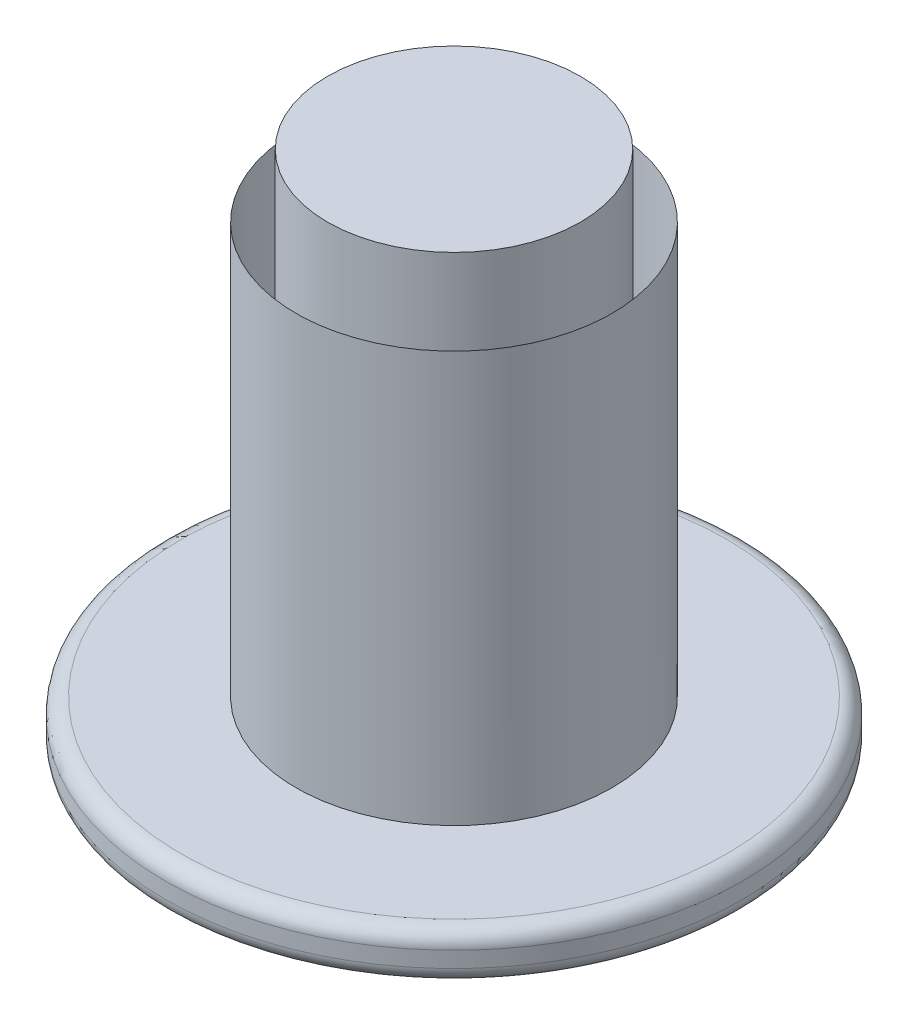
from build123d import *

# Parameters (mm, degrees)
FILLET1_R = 0.1


with BuildPart() as part:
    # Sketch1 → Revolve1 (revolve)
    with BuildSketch(Plane.XY, mode=Mode.PRIVATE) as revolve1_sk:
        Polygon((0, 0), (1.825, 0), (1.825, 0.3), (0.8, 0.3), (0.8, 3.3), (0, 3.3), align=None)
    revolve(revolve1_sk.sketch.rotate(Axis((0, 3.3, 0), (0, -1, 0)), 90), axis=Axis((0, 3.3, 0), (0, -1, 0)))

    # Fillet1
    fillet1_edges = [part.edges().sort_by_distance(p)[0] for p in [
        (0, 0.3, -1.825),
        (0, 0, -1.825),
    ]]
    fillet(fillet1_edges, radius=FILLET1_R)


solid = part.part
